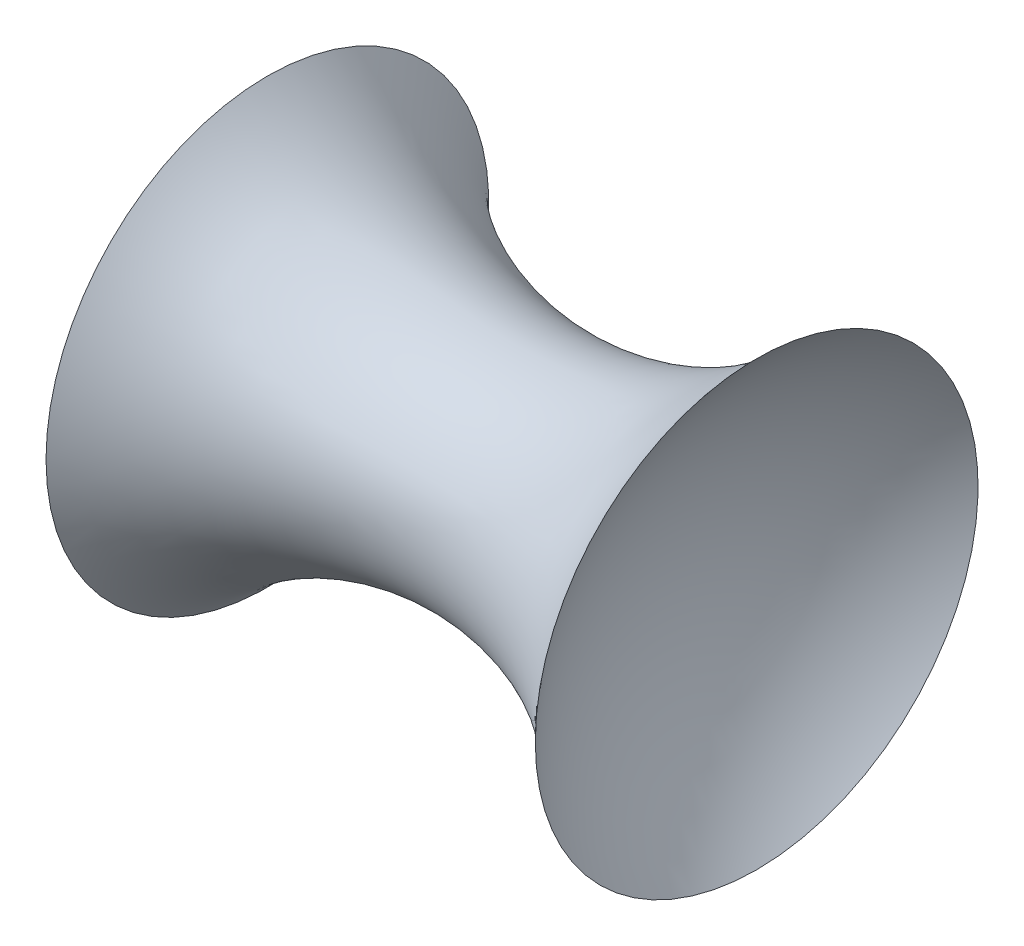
ISO-10303-21;
HEADER;
FILE_DESCRIPTION(('STEP AP214'),'2;1');
FILE_NAME('part.step','',(''),(''),'','','');
FILE_SCHEMA(('AUTOMOTIVE_DESIGN { 1 0 10303 214 1 1 1 1 }'));
ENDSEC;
DATA;
#1=APPLICATION_CONTEXT('core data for automotive mechanical design processes');
#2=APPLICATION_PROTOCOL_DEFINITION('international standard','automotive_design',2000,#1);
#3=PRODUCT_CONTEXT('',#1,'mechanical');
#4=PRODUCT('Part','Part','',(#3));
#5=PRODUCT_RELATED_PRODUCT_CATEGORY('part','',(#4));
#6=PRODUCT_DEFINITION_FORMATION('','',#4);
#7=PRODUCT_DEFINITION_CONTEXT('part definition',#1,'design');
#8=PRODUCT_DEFINITION('design','',#6,#7);
#9=PRODUCT_DEFINITION_SHAPE('','',#8);
#10=(LENGTH_UNIT() NAMED_UNIT(*) SI_UNIT(.MILLI.,.METRE.));
#11=(NAMED_UNIT(*) PLANE_ANGLE_UNIT() SI_UNIT($,.RADIAN.));
#12=(NAMED_UNIT(*) SI_UNIT($,.STERADIAN.) SOLID_ANGLE_UNIT());
#13=UNCERTAINTY_MEASURE_WITH_UNIT(LENGTH_MEASURE(1.E-05),#10,'distance_accuracy_value','');
#14=(GEOMETRIC_REPRESENTATION_CONTEXT(3) GLOBAL_UNCERTAINTY_ASSIGNED_CONTEXT((#13)) GLOBAL_UNIT_ASSIGNED_CONTEXT((#10,
#11,#12)) REPRESENTATION_CONTEXT('',''));
#15=CARTESIAN_POINT('',(0.,0.,0.));
#16=DIRECTION('',(0.,0.,1.));
#17=DIRECTION('',(1.,0.,0.));
#18=AXIS2_PLACEMENT_3D('',#15,#16,#17);
#19=CARTESIAN_POINT('',(22.2425938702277,0.,0.));
#20=DIRECTION('',(-1.,0.,0.));
#21=DIRECTION('',(0.,0.,1.));
#22=AXIS2_PLACEMENT_3D('',#19,#20,#21);
#23=TOROIDAL_SURFACE('',#22,20.1312448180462,15.);
#24=CARTESIAN_POINT('',(33.3638908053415,0.,0.));
#25=DIRECTION('',(-1.,0.,0.));
#26=DIRECTION('',(0.,0.,1.));
#27=AXIS2_PLACEMENT_3D('',#24,#25,#26);
#28=CIRCLE('',#27,10.0656224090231);
#29=CARTESIAN_POINT('',(33.3638908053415,0.,10.0656224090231));
#30=VERTEX_POINT('',#29);
#31=EDGE_CURVE('E10',#30,#30,#28,.T.);
#32=ORIENTED_EDGE('',*,*,#31,.T.);
#33=EDGE_LOOP('',(#32));
#34=FACE_BOUND('',#33,.T.);
#35=CARTESIAN_POINT('',(11.1212969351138,0.,0.));
#36=DIRECTION('',(-1.,0.,0.));
#37=DIRECTION('',(0.,0.,1.));
#38=AXIS2_PLACEMENT_3D('',#35,#36,#37);
#39=CIRCLE('',#38,10.0656224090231);
#40=CARTESIAN_POINT('',(11.1212969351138,0.,10.0656224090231));
#41=VERTEX_POINT('',#40);
#42=EDGE_CURVE('E37',#41,#41,#39,.T.);
#43=ORIENTED_EDGE('',*,*,#42,.F.);
#44=EDGE_LOOP('',(#43));
#45=FACE_BOUND('',#44,.T.);
#46=ADVANCED_FACE('F31',(#34,#45),#23,.F.);
#47=CARTESIAN_POINT('',(44.4851877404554,0.,0.));
#48=DIRECTION('',(-1.,0.,0.));
#49=DIRECTION('',(0.,-1.,0.));
#50=AXIS2_PLACEMENT_3D('',#47,#48,#49);
#51=SPHERICAL_SURFACE('',#50,15.);
#52=ORIENTED_EDGE('',*,*,#31,.F.);
#53=EDGE_LOOP('',(#52));
#54=FACE_BOUND('',#53,.T.);
#55=ADVANCED_FACE('F46',(#54),#51,.F.);
#56=CARTESIAN_POINT('',(0.,0.,0.));
#57=DIRECTION('',(-1.,0.,0.));
#58=DIRECTION('',(0.,1.,0.));
#59=AXIS2_PLACEMENT_3D('',#56,#57,#58);
#60=SPHERICAL_SURFACE('',#59,15.);
#61=ORIENTED_EDGE('',*,*,#42,.T.);
#62=EDGE_LOOP('',(#61));
#63=FACE_BOUND('',#62,.T.);
#64=ADVANCED_FACE('F43',(#63),#60,.F.);
#65=CLOSED_SHELL('',(#46,#55,#64));
#66=MANIFOLD_SOLID_BREP('B2',#65);
#67=ADVANCED_BREP_SHAPE_REPRESENTATION('',(#18,#66),#14);
#68=SHAPE_DEFINITION_REPRESENTATION(#9,#67);
ENDSEC;
END-ISO-10303-21;
